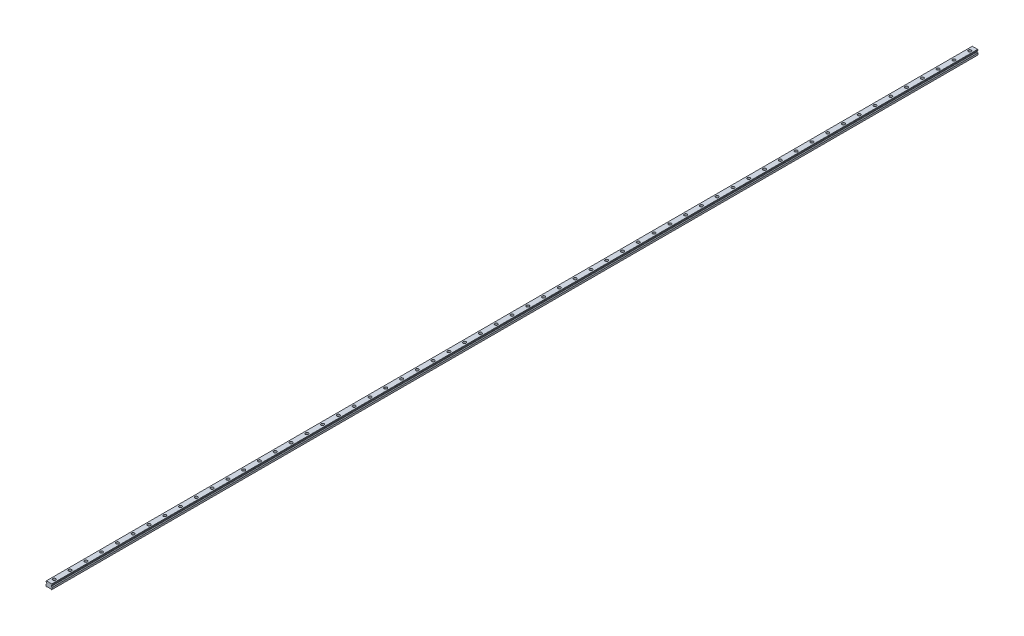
from build123d import *

# Parameters (mm, degrees)
SKETCH1_W           = 23
SKETCH1_H           = 19.2
BOSS_EXTRUDE1_DEPTH = 1760
CUT_EXTRUDE1_DEPTH  = 3521.071148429
CHAMFER1_SIZE       = 1.25
FILLET1_R           = 1.25
CUT_EXTRUDE2_DEPTH  = 3521.071148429
SKETCH4_R           = 5.5
SKETCH4_R_2         = 3.5
CUT_EXTRUDE3_DEPTH  = 9
SKETCH4_2_R         = 3.5
CUT_EXTRUDE4_DEPTH  = 1761.142292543
LPATTERN1_COUNT     = 59
LPATTERN1_PITCH     = 60


with BuildPart() as part:
    # Sketch1 → Boss-Extrude1 (new, symmetric)
    with BuildSketch(Plane.XY):
        with Locations((0, 9.6)):
            Rectangle(SKETCH1_W, SKETCH1_H)
    extrude(amount=BOSS_EXTRUDE1_DEPTH, both=True)

    # Sketch2 → Cut-Extrude1 (cut, through all)
    with BuildSketch(Plane.XY.offset(1760)):
        Polygon((-11.5, 16.7), (-11.5, 7.95), (-8.583333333, 10.866666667), (-8.583333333, 13.783333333), align=None)
        Polygon((8.583333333, 13.783333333), (11.5, 16.7), (11.5, 7.95), (8.583333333, 10.866666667), align=None)
    extrude(amount=-CUT_EXTRUDE1_DEPTH, mode=Mode.SUBTRACT)

    # Chamfer1
    chamfer1_edges = [part.edges().sort_by_distance(p)[0] for p in [
        (-11.5, 19.2, 0),
        (11.5, 19.2, 0),
        (11.5, 0, 0),
        (-11.5, 0, 0),
    ]]
    chamfer(chamfer1_edges, length=CHAMFER1_SIZE)

    # Fillet1
    fillet1_edges = [part.edges().sort_by_distance(p)[0] for p in [
        (-8.583333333, 13.783333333, 0),
        (-8.583333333, 10.866666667, 0),
        (8.583333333, 10.866666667, 0),
        (8.583333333, 13.783333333, 0),
    ]]
    fillet(fillet1_edges, radius=FILLET1_R)

    # Sketch3 → Cut-Extrude2 (cut, through all)
    with BuildSketch(Plane.XY.offset(1760)):
        Polygon((-7, 0), (-5.75, 1.25), (5.75, 1.25), (7, 0), align=None)
    extrude(amount=-CUT_EXTRUDE2_DEPTH, mode=Mode.SUBTRACT)

    # Sketch4 → Cut-Extrude3 (cut)
    with BuildSketch(Plane(origin=(0, 19.2, 0), x_dir=(1, 0, 0), z_dir=(0, 1, 0))):
        with Locations(Location((0, -1740, 0), (0, 0, 270))):
            Circle(SKETCH4_R)
        with Locations(Location((0, -1740, 0), (0, 0, 270))):
            Circle(SKETCH4_R_2, mode=Mode.SUBTRACT)
    cut_extrude3 = extrude(amount=-CUT_EXTRUDE3_DEPTH, mode=Mode.SUBTRACT)

    # Sketch4_2 → Cut-Extrude4 (cut, through all)
    with BuildSketch(Plane(origin=(0, 19.2, 0), x_dir=(1, 0, 0), z_dir=(0, 1, 0))):
        with Locations(Location((0, -1740, 0), (0, 0, 270))):
            Circle(SKETCH4_2_R)
    cut_extrude4 = extrude(amount=-CUT_EXTRUDE4_DEPTH, mode=Mode.SUBTRACT)

    # LPattern1: Cut-Extrude3, Cut-Extrude4 ×59
    with Locations(*[(0, 0, -i * LPATTERN1_PITCH) for i in range(1, LPATTERN1_COUNT)]):
        add(cut_extrude3, mode=Mode.SUBTRACT)
        add(cut_extrude4, mode=Mode.SUBTRACT)


solid = part.part
